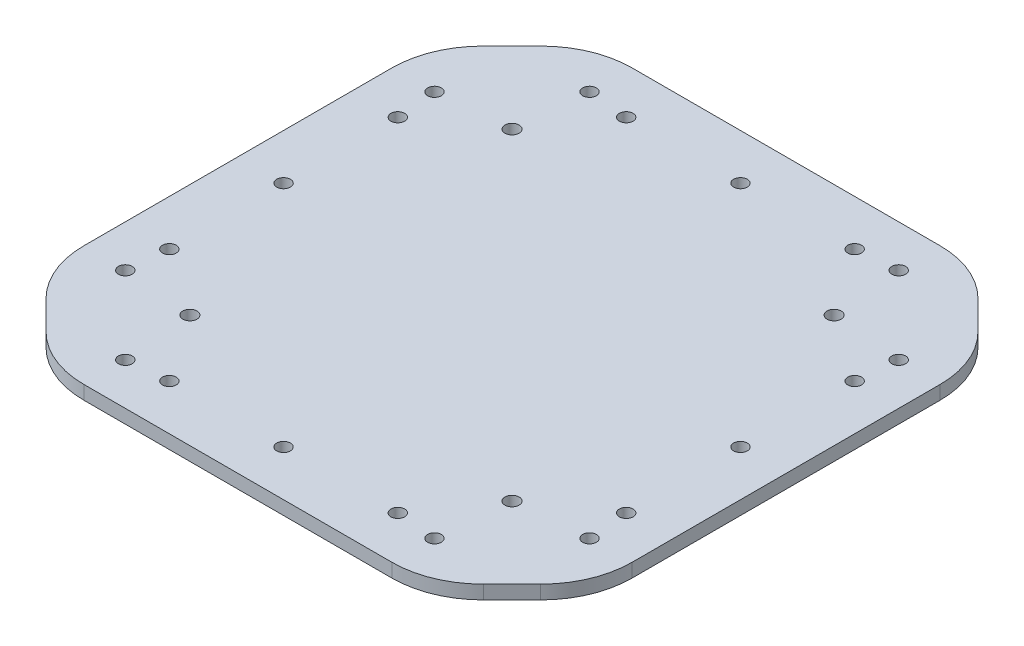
ISO-10303-21;
HEADER;
FILE_DESCRIPTION(('STEP AP214'),'2;1');
FILE_NAME('part.step','',(''),(''),'','','');
FILE_SCHEMA(('AUTOMOTIVE_DESIGN { 1 0 10303 214 1 1 1 1 }'));
ENDSEC;
DATA;
#1=APPLICATION_CONTEXT('core data for automotive mechanical design processes');
#2=APPLICATION_PROTOCOL_DEFINITION('international standard','automotive_design',2000,#1);
#3=PRODUCT_CONTEXT('',#1,'mechanical');
#4=PRODUCT('Part','Part','',(#3));
#5=PRODUCT_RELATED_PRODUCT_CATEGORY('part','',(#4));
#6=PRODUCT_DEFINITION_FORMATION('','',#4);
#7=PRODUCT_DEFINITION_CONTEXT('part definition',#1,'design');
#8=PRODUCT_DEFINITION('design','',#6,#7);
#9=PRODUCT_DEFINITION_SHAPE('','',#8);
#10=(LENGTH_UNIT() NAMED_UNIT(*) SI_UNIT(.MILLI.,.METRE.));
#11=(NAMED_UNIT(*) PLANE_ANGLE_UNIT() SI_UNIT($,.RADIAN.));
#12=(NAMED_UNIT(*) SI_UNIT($,.STERADIAN.) SOLID_ANGLE_UNIT());
#13=UNCERTAINTY_MEASURE_WITH_UNIT(LENGTH_MEASURE(1.E-05),#10,'distance_accuracy_value','');
#14=(GEOMETRIC_REPRESENTATION_CONTEXT(3) GLOBAL_UNCERTAINTY_ASSIGNED_CONTEXT((#13)) GLOBAL_UNIT_ASSIGNED_CONTEXT((#10,
#11,#12)) REPRESENTATION_CONTEXT('',''));
#15=CARTESIAN_POINT('',(0.,0.,0.));
#16=DIRECTION('',(0.,0.,1.));
#17=DIRECTION('',(1.,0.,0.));
#18=AXIS2_PLACEMENT_3D('',#15,#16,#17);
#19=CARTESIAN_POINT('',(-51.0000000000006,3.,50.9999999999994));
#20=DIRECTION('',(-0.707106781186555,0.,0.707106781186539));
#21=DIRECTION('',(0.70710678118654,0.,0.707106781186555));
#22=AXIS2_PLACEMENT_3D('',#19,#20,#21);
#23=PLANE('',#22);
#24=DIRECTION('',(-0.70710678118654,0.,-0.707106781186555));
#25=VECTOR('',#24,1.);
#26=CARTESIAN_POINT('',(-51.0000000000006,0.,50.9999999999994));
#27=LINE('',#26,#25);
#28=CARTESIAN_POINT('',(-47.8578643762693,0.,54.1421356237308));
#29=VERTEX_POINT('',#28);
#30=CARTESIAN_POINT('',(-54.1421356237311,0.,47.8578643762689));
#31=VERTEX_POINT('',#30);
#32=EDGE_CURVE('E192',#29,#31,#27,.T.);
#33=ORIENTED_EDGE('',*,*,#32,.F.);
#34=DIRECTION('',(0.,-1.,0.));
#35=VECTOR('',#34,1.);
#36=CARTESIAN_POINT('',(-47.8578643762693,3.,54.1421356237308));
#37=LINE('',#36,#35);
#38=CARTESIAN_POINT('',(-47.8578643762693,3.,54.1421356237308));
#39=VERTEX_POINT('',#38);
#40=EDGE_CURVE('E166',#29,#39,#37,.F.);
#41=ORIENTED_EDGE('',*,*,#40,.T.);
#42=DIRECTION('',(-0.70710678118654,0.,-0.707106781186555));
#43=VECTOR('',#42,1.);
#44=CARTESIAN_POINT('',(-51.0000000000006,3.,50.9999999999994));
#45=LINE('',#44,#43);
#46=CARTESIAN_POINT('',(-54.1421356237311,3.,47.8578643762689));
#47=VERTEX_POINT('',#46);
#48=EDGE_CURVE('E328',#39,#47,#45,.T.);
#49=ORIENTED_EDGE('',*,*,#48,.T.);
#50=DIRECTION('',(0.,-1.,0.));
#51=VECTOR('',#50,1.);
#52=CARTESIAN_POINT('',(-54.1421356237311,0.,47.8578643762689));
#53=LINE('',#52,#51);
#54=EDGE_CURVE('E172',#47,#31,#53,.T.);
#55=ORIENTED_EDGE('',*,*,#54,.T.);
#56=EDGE_LOOP('',(#33,#41,#49,#55));
#57=FACE_BOUND('',#56,.T.);
#58=ADVANCED_FACE('F45',(#57),#23,.T.);
#59=CARTESIAN_POINT('',(0.,3.,60.));
#60=DIRECTION('',(0.,0.,-1.));
#61=DIRECTION('',(-1.,0.,0.));
#62=AXIS2_PLACEMENT_3D('',#59,#60,#61);
#63=PLANE('',#62);
#64=DIRECTION('',(1.,0.,0.));
#65=VECTOR('',#64,1.);
#66=CARTESIAN_POINT('',(0.,3.,60.));
#67=LINE('',#66,#65);
#68=CARTESIAN_POINT('',(-33.7157287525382,3.,60.));
#69=VERTEX_POINT('',#68);
#70=CARTESIAN_POINT('',(33.7157287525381,3.,60.));
#71=VERTEX_POINT('',#70);
#72=EDGE_CURVE('E182',#69,#71,#67,.T.);
#73=ORIENTED_EDGE('',*,*,#72,.F.);
#74=DIRECTION('',(0.,-1.,0.));
#75=VECTOR('',#74,1.);
#76=CARTESIAN_POINT('',(-33.7157287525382,0.,60.));
#77=LINE('',#76,#75);
#78=CARTESIAN_POINT('',(-33.7157287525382,0.,60.));
#79=VERTEX_POINT('',#78);
#80=EDGE_CURVE('E165',#69,#79,#77,.T.);
#81=ORIENTED_EDGE('',*,*,#80,.T.);
#82=DIRECTION('',(1.,0.,0.));
#83=VECTOR('',#82,1.);
#84=CARTESIAN_POINT('',(0.,0.,60.));
#85=LINE('',#84,#83);
#86=CARTESIAN_POINT('',(33.7157287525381,0.,60.));
#87=VERTEX_POINT('',#86);
#88=EDGE_CURVE('E179',#79,#87,#85,.T.);
#89=ORIENTED_EDGE('',*,*,#88,.T.);
#90=DIRECTION('',(0.,-1.,0.));
#91=VECTOR('',#90,1.);
#92=CARTESIAN_POINT('',(33.7157287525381,3.,60.));
#93=LINE('',#92,#91);
#94=EDGE_CURVE('E185',#87,#71,#93,.F.);
#95=ORIENTED_EDGE('',*,*,#94,.T.);
#96=EDGE_LOOP('',(#73,#81,#89,#95));
#97=FACE_BOUND('',#96,.T.);
#98=ADVANCED_FACE('F178',(#97),#63,.F.);
#99=CARTESIAN_POINT('',(50.9999999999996,3.,51.0000000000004));
#100=DIRECTION('',(0.707106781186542,0.,0.707106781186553));
#101=DIRECTION('',(0.707106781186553,0.,-0.707106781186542));
#102=AXIS2_PLACEMENT_3D('',#99,#100,#101);
#103=PLANE('',#102);
#104=DIRECTION('',(-0.707106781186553,0.,0.707106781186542));
#105=VECTOR('',#104,1.);
#106=CARTESIAN_POINT('',(50.9999999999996,3.,51.0000000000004));
#107=LINE('',#106,#105);
#108=CARTESIAN_POINT('',(54.1421356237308,3.,47.8578643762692));
#109=VERTEX_POINT('',#108);
#110=CARTESIAN_POINT('',(47.8578643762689,3.,54.1421356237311));
#111=VERTEX_POINT('',#110);
#112=EDGE_CURVE('E334',#109,#111,#107,.T.);
#113=ORIENTED_EDGE('',*,*,#112,.T.);
#114=DIRECTION('',(0.,-1.,0.));
#115=VECTOR('',#114,1.);
#116=CARTESIAN_POINT('',(47.8578643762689,0.,54.1421356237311));
#117=LINE('',#116,#115);
#118=CARTESIAN_POINT('',(47.8578643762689,0.,54.1421356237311));
#119=VERTEX_POINT('',#118);
#120=EDGE_CURVE('E279',#111,#119,#117,.T.);
#121=ORIENTED_EDGE('',*,*,#120,.T.);
#122=DIRECTION('',(-0.707106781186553,0.,0.707106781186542));
#123=VECTOR('',#122,1.);
#124=CARTESIAN_POINT('',(50.9999999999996,0.,51.0000000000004));
#125=LINE('',#124,#123);
#126=CARTESIAN_POINT('',(54.1421356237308,0.,47.8578643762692));
#127=VERTEX_POINT('',#126);
#128=EDGE_CURVE('E191',#127,#119,#125,.T.);
#129=ORIENTED_EDGE('',*,*,#128,.F.);
#130=DIRECTION('',(0.,-1.,0.));
#131=VECTOR('',#130,1.);
#132=CARTESIAN_POINT('',(54.1421356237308,3.,47.8578643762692));
#133=LINE('',#132,#131);
#134=EDGE_CURVE('E276',#127,#109,#133,.F.);
#135=ORIENTED_EDGE('',*,*,#134,.T.);
#136=EDGE_LOOP('',(#113,#121,#129,#135));
#137=FACE_BOUND('',#136,.T.);
#138=ADVANCED_FACE('F472',(#137),#103,.T.);
#139=CARTESIAN_POINT('',(60.,3.,0.));
#140=DIRECTION('',(1.,0.,0.));
#141=DIRECTION('',(0.,0.,-1.));
#142=AXIS2_PLACEMENT_3D('',#139,#140,#141);
#143=PLANE('',#142);
#144=DIRECTION('',(0.,0.,1.));
#145=VECTOR('',#144,1.);
#146=CARTESIAN_POINT('',(60.,3.,0.));
#147=LINE('',#146,#145);
#148=CARTESIAN_POINT('',(60.,3.,-33.7157287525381));
#149=VERTEX_POINT('',#148);
#150=CARTESIAN_POINT('',(60.,3.,33.7157287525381));
#151=VERTEX_POINT('',#150);
#152=EDGE_CURVE('E344',#149,#151,#147,.T.);
#153=ORIENTED_EDGE('',*,*,#152,.T.);
#154=DIRECTION('',(0.,-1.,0.));
#155=VECTOR('',#154,1.);
#156=CARTESIAN_POINT('',(60.,3.,33.7157287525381));
#157=LINE('',#156,#155);
#158=CARTESIAN_POINT('',(60.,0.,33.7157287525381));
#159=VERTEX_POINT('',#158);
#160=EDGE_CURVE('E286',#151,#159,#157,.T.);
#161=ORIENTED_EDGE('',*,*,#160,.T.);
#162=DIRECTION('',(0.,0.,1.));
#163=VECTOR('',#162,1.);
#164=CARTESIAN_POINT('',(60.,0.,0.));
#165=LINE('',#164,#163);
#166=CARTESIAN_POINT('',(60.,0.,-33.7157287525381));
#167=VERTEX_POINT('',#166);
#168=EDGE_CURVE('E196',#167,#159,#165,.T.);
#169=ORIENTED_EDGE('',*,*,#168,.F.);
#170=DIRECTION('',(0.,-1.,0.));
#171=VECTOR('',#170,1.);
#172=CARTESIAN_POINT('',(60.,3.,-33.7157287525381));
#173=LINE('',#172,#171);
#174=EDGE_CURVE('E283',#167,#149,#173,.F.);
#175=ORIENTED_EDGE('',*,*,#174,.T.);
#176=EDGE_LOOP('',(#153,#161,#169,#175));
#177=FACE_BOUND('',#176,.T.);
#178=ADVANCED_FACE('F477',(#177),#143,.T.);
#179=CARTESIAN_POINT('',(51.0000000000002,3.,-50.9999999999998));
#180=DIRECTION('',(0.70710678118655,0.,-0.707106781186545));
#181=DIRECTION('',(-0.707106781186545,0.,-0.70710678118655));
#182=AXIS2_PLACEMENT_3D('',#179,#180,#181);
#183=PLANE('',#182);
#184=DIRECTION('',(0.707106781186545,0.,0.70710678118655));
#185=VECTOR('',#184,1.);
#186=CARTESIAN_POINT('',(51.0000000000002,0.,-50.9999999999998));
#187=LINE('',#186,#185);
#188=CARTESIAN_POINT('',(47.8578643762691,0.,-54.1421356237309));
#189=VERTEX_POINT('',#188);
#190=CARTESIAN_POINT('',(54.142135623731,0.,-47.857864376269));
#191=VERTEX_POINT('',#190);
#192=EDGE_CURVE('E205',#189,#191,#187,.T.);
#193=ORIENTED_EDGE('',*,*,#192,.F.);
#194=DIRECTION('',(0.,-1.,0.));
#195=VECTOR('',#194,1.);
#196=CARTESIAN_POINT('',(47.8578643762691,3.,-54.1421356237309));
#197=LINE('',#196,#195);
#198=CARTESIAN_POINT('',(47.8578643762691,3.,-54.1421356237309));
#199=VERTEX_POINT('',#198);
#200=EDGE_CURVE('E301',#189,#199,#197,.F.);
#201=ORIENTED_EDGE('',*,*,#200,.T.);
#202=DIRECTION('',(0.707106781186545,0.,0.70710678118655));
#203=VECTOR('',#202,1.);
#204=CARTESIAN_POINT('',(51.0000000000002,3.,-50.9999999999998));
#205=LINE('',#204,#203);
#206=CARTESIAN_POINT('',(54.142135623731,3.,-47.857864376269));
#207=VERTEX_POINT('',#206);
#208=EDGE_CURVE('E348',#199,#207,#205,.T.);
#209=ORIENTED_EDGE('',*,*,#208,.T.);
#210=DIRECTION('',(0.,-1.,0.));
#211=VECTOR('',#210,1.);
#212=CARTESIAN_POINT('',(54.142135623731,3.,-47.857864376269));
#213=LINE('',#212,#211);
#214=EDGE_CURVE('E297',#207,#191,#213,.T.);
#215=ORIENTED_EDGE('',*,*,#214,.T.);
#216=EDGE_LOOP('',(#193,#201,#209,#215));
#217=FACE_BOUND('',#216,.T.);
#218=ADVANCED_FACE('F481',(#217),#183,.T.);
#219=CARTESIAN_POINT('',(0.,3.,-60.));
#220=DIRECTION('',(0.,0.,-1.));
#221=DIRECTION('',(-1.,0.,0.));
#222=AXIS2_PLACEMENT_3D('',#219,#220,#221);
#223=PLANE('',#222);
#224=DIRECTION('',(1.,0.,0.));
#225=VECTOR('',#224,1.);
#226=CARTESIAN_POINT('',(0.,3.,-60.));
#227=LINE('',#226,#225);
#228=CARTESIAN_POINT('',(-33.7157287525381,3.,-60.));
#229=VERTEX_POINT('',#228);
#230=CARTESIAN_POINT('',(33.7157287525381,3.,-60.));
#231=VERTEX_POINT('',#230);
#232=EDGE_CURVE('E317',#229,#231,#227,.T.);
#233=ORIENTED_EDGE('',*,*,#232,.T.);
#234=DIRECTION('',(0.,-1.,0.));
#235=VECTOR('',#234,1.);
#236=CARTESIAN_POINT('',(33.7157287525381,3.,-60.));
#237=LINE('',#236,#235);
#238=CARTESIAN_POINT('',(33.7157287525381,0.,-60.));
#239=VERTEX_POINT('',#238);
#240=EDGE_CURVE('E293',#231,#239,#237,.T.);
#241=ORIENTED_EDGE('',*,*,#240,.T.);
#242=DIRECTION('',(1.,0.,0.));
#243=VECTOR('',#242,1.);
#244=CARTESIAN_POINT('',(0.,0.,-60.));
#245=LINE('',#244,#243);
#246=CARTESIAN_POINT('',(-33.7157287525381,0.,-60.));
#247=VERTEX_POINT('',#246);
#248=EDGE_CURVE('E209',#247,#239,#245,.T.);
#249=ORIENTED_EDGE('',*,*,#248,.F.);
#250=DIRECTION('',(0.,-1.,0.));
#251=VECTOR('',#250,1.);
#252=CARTESIAN_POINT('',(-33.7157287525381,3.,-60.));
#253=LINE('',#252,#251);
#254=EDGE_CURVE('E290',#247,#229,#253,.F.);
#255=ORIENTED_EDGE('',*,*,#254,.T.);
#256=EDGE_LOOP('',(#233,#241,#249,#255));
#257=FACE_BOUND('',#256,.T.);
#258=ADVANCED_FACE('F465',(#257),#223,.T.);
#259=CARTESIAN_POINT('',(-51.,3.,-51.));
#260=DIRECTION('',(-0.707106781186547,0.,-0.707106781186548));
#261=DIRECTION('',(-0.707106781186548,0.,0.707106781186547));
#262=AXIS2_PLACEMENT_3D('',#259,#260,#261);
#263=PLANE('',#262);
#264=DIRECTION('',(0.707106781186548,0.,-0.707106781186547));
#265=VECTOR('',#264,1.);
#266=CARTESIAN_POINT('',(-51.,3.,-51.));
#267=LINE('',#266,#265);
#268=CARTESIAN_POINT('',(-54.1421356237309,3.,-47.8578643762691));
#269=VERTEX_POINT('',#268);
#270=CARTESIAN_POINT('',(-47.857864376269,3.,-54.142135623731));
#271=VERTEX_POINT('',#270);
#272=EDGE_CURVE('E309',#269,#271,#267,.T.);
#273=ORIENTED_EDGE('',*,*,#272,.T.);
#274=DIRECTION('',(0.,-1.,0.));
#275=VECTOR('',#274,1.);
#276=CARTESIAN_POINT('',(-47.857864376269,3.,-54.142135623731));
#277=LINE('',#276,#275);
#278=CARTESIAN_POINT('',(-47.857864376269,0.,-54.142135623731));
#279=VERTEX_POINT('',#278);
#280=EDGE_CURVE('E11',#271,#279,#277,.T.);
#281=ORIENTED_EDGE('',*,*,#280,.T.);
#282=DIRECTION('',(0.707106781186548,0.,-0.707106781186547));
#283=VECTOR('',#282,1.);
#284=CARTESIAN_POINT('',(-51.,0.,-51.));
#285=LINE('',#284,#283);
#286=CARTESIAN_POINT('',(-54.1421356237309,0.,-47.8578643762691));
#287=VERTEX_POINT('',#286);
#288=EDGE_CURVE('E213',#287,#279,#285,.T.);
#289=ORIENTED_EDGE('',*,*,#288,.F.);
#290=DIRECTION('',(0.,-1.,0.));
#291=VECTOR('',#290,1.);
#292=CARTESIAN_POINT('',(-54.1421356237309,3.,-47.8578643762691));
#293=LINE('',#292,#291);
#294=EDGE_CURVE('E54',#287,#269,#293,.F.);
#295=ORIENTED_EDGE('',*,*,#294,.T.);
#296=EDGE_LOOP('',(#273,#281,#289,#295));
#297=FACE_BOUND('',#296,.T.);
#298=ADVANCED_FACE('F308',(#297),#263,.T.);
#299=CARTESIAN_POINT('',(-35.2512626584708,3.,-35.2512626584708));
#300=DIRECTION('',(0.,-1.,0.));
#301=DIRECTION('',(0.,0.,-1.));
#302=AXIS2_PLACEMENT_3D('',#299,#300,#301);
#303=CYLINDRICAL_SURFACE('',#302,1.55579192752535);
#304=CARTESIAN_POINT('',(-35.2512626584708,3.,-35.2512626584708));
#305=DIRECTION('',(0.,1.,0.));
#306=DIRECTION('',(0.,0.,1.));
#307=AXIS2_PLACEMENT_3D('',#304,#305,#306);
#308=CIRCLE('',#307,1.55579192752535);
#309=CARTESIAN_POINT('',(-35.2512626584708,3.,-33.6954707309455));
#310=VERTEX_POINT('',#309);
#311=EDGE_CURVE('E330',#310,#310,#308,.T.);
#312=ORIENTED_EDGE('',*,*,#311,.T.);
#313=EDGE_LOOP('',(#312));
#314=FACE_BOUND('',#313,.T.);
#315=CARTESIAN_POINT('',(-35.2512626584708,0.,-35.2512626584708));
#316=DIRECTION('',(0.,1.,0.));
#317=DIRECTION('',(0.,0.,1.));
#318=AXIS2_PLACEMENT_3D('',#315,#316,#317);
#319=CIRCLE('',#318,1.55579192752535);
#320=CARTESIAN_POINT('',(-35.2512626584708,0.,-33.6954707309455));
#321=VERTEX_POINT('',#320);
#322=EDGE_CURVE('E198',#321,#321,#319,.T.);
#323=ORIENTED_EDGE('',*,*,#322,.F.);
#324=EDGE_LOOP('',(#323));
#325=FACE_BOUND('',#324,.T.);
#326=ADVANCED_FACE('F453',(#314,#325),#303,.F.);
#327=CARTESIAN_POINT('',(-33.8370490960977,3.,-50.8076118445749));
#328=DIRECTION('',(0.,-1.,0.));
#329=DIRECTION('',(0.,0.,-1.));
#330=AXIS2_PLACEMENT_3D('',#327,#328,#329);
#331=CYLINDRICAL_SURFACE('',#330,1.50000000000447);
#332=CARTESIAN_POINT('',(-33.8370490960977,3.,-50.8076118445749));
#333=DIRECTION('',(0.,1.,0.));
#334=DIRECTION('',(0.,0.,1.));
#335=AXIS2_PLACEMENT_3D('',#332,#333,#334);
#336=CIRCLE('',#335,1.50000000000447);
#337=CARTESIAN_POINT('',(-33.8370490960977,3.,-49.3076118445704));
#338=VERTEX_POINT('',#337);
#339=EDGE_CURVE('E337',#338,#338,#336,.T.);
#340=ORIENTED_EDGE('',*,*,#339,.T.);
#341=EDGE_LOOP('',(#340));
#342=FACE_BOUND('',#341,.T.);
#343=CARTESIAN_POINT('',(-33.8370490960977,0.,-50.8076118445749));
#344=DIRECTION('',(0.,1.,0.));
#345=DIRECTION('',(0.,0.,1.));
#346=AXIS2_PLACEMENT_3D('',#343,#344,#345);
#347=CIRCLE('',#346,1.50000000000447);
#348=CARTESIAN_POINT('',(-33.8370490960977,0.,-49.3076118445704));
#349=VERTEX_POINT('',#348);
#350=EDGE_CURVE('E445',#349,#349,#347,.T.);
#351=ORIENTED_EDGE('',*,*,#350,.F.);
#352=EDGE_LOOP('',(#351));
#353=FACE_BOUND('',#352,.T.);
#354=ADVANCED_FACE('F455',(#342,#353),#331,.F.);
#355=CARTESIAN_POINT('',(-50.8076118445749,3.,-33.8370490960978));
#356=DIRECTION('',(0.,-1.,0.));
#357=DIRECTION('',(0.,0.,-1.));
#358=AXIS2_PLACEMENT_3D('',#355,#356,#357);
#359=CYLINDRICAL_SURFACE('',#358,1.50000000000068);
#360=CARTESIAN_POINT('',(-50.8076118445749,3.,-33.8370490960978));
#361=DIRECTION('',(0.,1.,0.));
#362=DIRECTION('',(0.,0.,1.));
#363=AXIS2_PLACEMENT_3D('',#360,#361,#362);
#364=CIRCLE('',#363,1.50000000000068);
#365=CARTESIAN_POINT('',(-50.8076118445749,3.,-32.3370490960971));
#366=VERTEX_POINT('',#365);
#367=EDGE_CURVE('E585',#366,#366,#364,.T.);
#368=ORIENTED_EDGE('',*,*,#367,.T.);
#369=EDGE_LOOP('',(#368));
#370=FACE_BOUND('',#369,.T.);
#371=CARTESIAN_POINT('',(-50.8076118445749,0.,-33.8370490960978));
#372=DIRECTION('',(0.,1.,0.));
#373=DIRECTION('',(0.,0.,1.));
#374=AXIS2_PLACEMENT_3D('',#371,#372,#373);
#375=CIRCLE('',#374,1.50000000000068);
#376=CARTESIAN_POINT('',(-50.8076118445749,0.,-32.3370490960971));
#377=VERTEX_POINT('',#376);
#378=EDGE_CURVE('E441',#377,#377,#375,.T.);
#379=ORIENTED_EDGE('',*,*,#378,.F.);
#380=EDGE_LOOP('',(#379));
#381=FACE_BOUND('',#380,.T.);
#382=ADVANCED_FACE('F462',(#370,#381),#359,.F.);
#383=CARTESIAN_POINT('',(33.8370490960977,3.,-50.8076118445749));
#384=DIRECTION('',(0.,-1.,0.));
#385=DIRECTION('',(0.,0.,-1.));
#386=AXIS2_PLACEMENT_3D('',#383,#384,#385);
#387=CYLINDRICAL_SURFACE('',#386,1.50000000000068);
#388=CARTESIAN_POINT('',(33.8370490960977,3.,-50.8076118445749));
#389=DIRECTION('',(0.,1.,0.));
#390=DIRECTION('',(0.,0.,1.));
#391=AXIS2_PLACEMENT_3D('',#388,#389,#390);
#392=CIRCLE('',#391,1.50000000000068);
#393=CARTESIAN_POINT('',(33.8370490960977,3.,-49.3076118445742));
#394=VERTEX_POINT('',#393);
#395=EDGE_CURVE('E581',#394,#394,#392,.T.);
#396=ORIENTED_EDGE('',*,*,#395,.T.);
#397=EDGE_LOOP('',(#396));
#398=FACE_BOUND('',#397,.T.);
#399=CARTESIAN_POINT('',(33.8370490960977,0.,-50.8076118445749));
#400=DIRECTION('',(0.,1.,0.));
#401=DIRECTION('',(0.,0.,1.));
#402=AXIS2_PLACEMENT_3D('',#399,#400,#401);
#403=CIRCLE('',#402,1.50000000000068);
#404=CARTESIAN_POINT('',(33.8370490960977,0.,-49.3076118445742));
#405=VERTEX_POINT('',#404);
#406=EDGE_CURVE('E437',#405,#405,#403,.T.);
#407=ORIENTED_EDGE('',*,*,#406,.F.);
#408=EDGE_LOOP('',(#407));
#409=FACE_BOUND('',#408,.T.);
#410=ADVANCED_FACE('F688',(#398,#409),#387,.F.);
#411=CARTESIAN_POINT('',(35.2512626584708,3.,-35.2512626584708));
#412=DIRECTION('',(0.,-1.,0.));
#413=DIRECTION('',(0.,0.,-1.));
#414=AXIS2_PLACEMENT_3D('',#411,#412,#413);
#415=CYLINDRICAL_SURFACE('',#414,1.55579192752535);
#416=CARTESIAN_POINT('',(35.2512626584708,3.,-35.2512626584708));
#417=DIRECTION('',(0.,1.,0.));
#418=DIRECTION('',(0.,0.,1.));
#419=AXIS2_PLACEMENT_3D('',#416,#417,#418);
#420=CIRCLE('',#419,1.55579192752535);
#421=CARTESIAN_POINT('',(35.2512626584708,3.,-33.6954707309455));
#422=VERTEX_POINT('',#421);
#423=EDGE_CURVE('E577',#422,#422,#420,.T.);
#424=ORIENTED_EDGE('',*,*,#423,.T.);
#425=EDGE_LOOP('',(#424));
#426=FACE_BOUND('',#425,.T.);
#427=CARTESIAN_POINT('',(35.2512626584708,0.,-35.2512626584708));
#428=DIRECTION('',(0.,1.,0.));
#429=DIRECTION('',(0.,0.,1.));
#430=AXIS2_PLACEMENT_3D('',#427,#428,#429);
#431=CIRCLE('',#430,1.55579192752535);
#432=CARTESIAN_POINT('',(35.2512626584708,0.,-33.6954707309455));
#433=VERTEX_POINT('',#432);
#434=EDGE_CURVE('E433',#433,#433,#431,.T.);
#435=ORIENTED_EDGE('',*,*,#434,.F.);
#436=EDGE_LOOP('',(#435));
#437=FACE_BOUND('',#436,.T.);
#438=ADVANCED_FACE('F694',(#426,#437),#415,.F.);
#439=CARTESIAN_POINT('',(50.8076118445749,3.,-33.8370490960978));
#440=DIRECTION('',(0.,-1.,0.));
#441=DIRECTION('',(0.,0.,-1.));
#442=AXIS2_PLACEMENT_3D('',#439,#440,#441);
#443=CYLINDRICAL_SURFACE('',#442,1.50000000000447);
#444=CARTESIAN_POINT('',(50.8076118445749,3.,-33.8370490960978));
#445=DIRECTION('',(0.,1.,0.));
#446=DIRECTION('',(0.,0.,1.));
#447=AXIS2_PLACEMENT_3D('',#444,#445,#446);
#448=CIRCLE('',#447,1.50000000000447);
#449=CARTESIAN_POINT('',(50.8076118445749,3.,-32.3370490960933));
#450=VERTEX_POINT('',#449);
#451=EDGE_CURVE('E573',#450,#450,#448,.T.);
#452=ORIENTED_EDGE('',*,*,#451,.T.);
#453=EDGE_LOOP('',(#452));
#454=FACE_BOUND('',#453,.T.);
#455=CARTESIAN_POINT('',(50.8076118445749,0.,-33.8370490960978));
#456=DIRECTION('',(0.,1.,0.));
#457=DIRECTION('',(0.,0.,1.));
#458=AXIS2_PLACEMENT_3D('',#455,#456,#457);
#459=CIRCLE('',#458,1.50000000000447);
#460=CARTESIAN_POINT('',(50.8076118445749,0.,-32.3370490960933));
#461=VERTEX_POINT('',#460);
#462=EDGE_CURVE('E429',#461,#461,#459,.T.);
#463=ORIENTED_EDGE('',*,*,#462,.F.);
#464=EDGE_LOOP('',(#463));
#465=FACE_BOUND('',#464,.T.);
#466=ADVANCED_FACE('F700',(#454,#465),#443,.F.);
#467=CARTESIAN_POINT('',(50.8076118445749,3.,33.8370490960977));
#468=DIRECTION('',(0.,-1.,0.));
#469=DIRECTION('',(0.,0.,-1.));
#470=AXIS2_PLACEMENT_3D('',#467,#468,#469);
#471=CYLINDRICAL_SURFACE('',#470,1.50000000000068);
#472=CARTESIAN_POINT('',(50.8076118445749,3.,33.8370490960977));
#473=DIRECTION('',(0.,1.,0.));
#474=DIRECTION('',(0.,0.,1.));
#475=AXIS2_PLACEMENT_3D('',#472,#473,#474);
#476=CIRCLE('',#475,1.50000000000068);
#477=CARTESIAN_POINT('',(50.8076118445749,3.,35.3370490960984));
#478=VERTEX_POINT('',#477);
#479=EDGE_CURVE('E569',#478,#478,#476,.T.);
#480=ORIENTED_EDGE('',*,*,#479,.T.);
#481=EDGE_LOOP('',(#480));
#482=FACE_BOUND('',#481,.T.);
#483=CARTESIAN_POINT('',(50.8076118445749,0.,33.8370490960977));
#484=DIRECTION('',(0.,1.,0.));
#485=DIRECTION('',(0.,0.,1.));
#486=AXIS2_PLACEMENT_3D('',#483,#484,#485);
#487=CIRCLE('',#486,1.50000000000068);
#488=CARTESIAN_POINT('',(50.8076118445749,0.,35.3370490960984));
#489=VERTEX_POINT('',#488);
#490=EDGE_CURVE('E425',#489,#489,#487,.T.);
#491=ORIENTED_EDGE('',*,*,#490,.F.);
#492=EDGE_LOOP('',(#491));
#493=FACE_BOUND('',#492,.T.);
#494=ADVANCED_FACE('F704',(#482,#493),#471,.F.);
#495=CARTESIAN_POINT('',(35.2512626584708,3.,35.2512626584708));
#496=DIRECTION('',(0.,-1.,0.));
#497=DIRECTION('',(0.,0.,-1.));
#498=AXIS2_PLACEMENT_3D('',#495,#496,#497);
#499=CYLINDRICAL_SURFACE('',#498,1.55579192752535);
#500=CARTESIAN_POINT('',(35.2512626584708,3.,35.2512626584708));
#501=DIRECTION('',(0.,1.,0.));
#502=DIRECTION('',(0.,0.,1.));
#503=AXIS2_PLACEMENT_3D('',#500,#501,#502);
#504=CIRCLE('',#503,1.55579192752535);
#505=CARTESIAN_POINT('',(35.2512626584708,3.,36.8070545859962));
#506=VERTEX_POINT('',#505);
#507=EDGE_CURVE('E565',#506,#506,#504,.T.);
#508=ORIENTED_EDGE('',*,*,#507,.T.);
#509=EDGE_LOOP('',(#508));
#510=FACE_BOUND('',#509,.T.);
#511=CARTESIAN_POINT('',(35.2512626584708,0.,35.2512626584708));
#512=DIRECTION('',(0.,1.,0.));
#513=DIRECTION('',(0.,0.,1.));
#514=AXIS2_PLACEMENT_3D('',#511,#512,#513);
#515=CIRCLE('',#514,1.55579192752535);
#516=CARTESIAN_POINT('',(35.2512626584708,0.,36.8070545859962));
#517=VERTEX_POINT('',#516);
#518=EDGE_CURVE('E421',#517,#517,#515,.T.);
#519=ORIENTED_EDGE('',*,*,#518,.F.);
#520=EDGE_LOOP('',(#519));
#521=FACE_BOUND('',#520,.T.);
#522=ADVANCED_FACE('F708',(#510,#521),#499,.F.);
#523=CARTESIAN_POINT('',(33.8370490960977,3.,50.8076118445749));
#524=DIRECTION('',(0.,-1.,0.));
#525=DIRECTION('',(0.,0.,-1.));
#526=AXIS2_PLACEMENT_3D('',#523,#524,#525);
#527=CYLINDRICAL_SURFACE('',#526,1.50000000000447);
#528=CARTESIAN_POINT('',(33.8370490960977,3.,50.8076118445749));
#529=DIRECTION('',(0.,1.,0.));
#530=DIRECTION('',(0.,0.,1.));
#531=AXIS2_PLACEMENT_3D('',#528,#529,#530);
#532=CIRCLE('',#531,1.50000000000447);
#533=CARTESIAN_POINT('',(33.8370490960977,3.,52.3076118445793));
#534=VERTEX_POINT('',#533);
#535=EDGE_CURVE('E561',#534,#534,#532,.T.);
#536=ORIENTED_EDGE('',*,*,#535,.T.);
#537=EDGE_LOOP('',(#536));
#538=FACE_BOUND('',#537,.T.);
#539=CARTESIAN_POINT('',(33.8370490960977,0.,50.8076118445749));
#540=DIRECTION('',(0.,1.,0.));
#541=DIRECTION('',(0.,0.,1.));
#542=AXIS2_PLACEMENT_3D('',#539,#540,#541);
#543=CIRCLE('',#542,1.50000000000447);
#544=CARTESIAN_POINT('',(33.8370490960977,0.,52.3076118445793));
#545=VERTEX_POINT('',#544);
#546=EDGE_CURVE('E417',#545,#545,#543,.T.);
#547=ORIENTED_EDGE('',*,*,#546,.F.);
#548=EDGE_LOOP('',(#547));
#549=FACE_BOUND('',#548,.T.);
#550=ADVANCED_FACE('F712',(#538,#549),#527,.F.);
#551=CARTESIAN_POINT('',(-33.8370490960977,3.,50.8076118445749));
#552=DIRECTION('',(0.,-1.,0.));
#553=DIRECTION('',(0.,0.,-1.));
#554=AXIS2_PLACEMENT_3D('',#551,#552,#553);
#555=CYLINDRICAL_SURFACE('',#554,1.50000000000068);
#556=CARTESIAN_POINT('',(-33.8370490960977,3.,50.8076118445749));
#557=DIRECTION('',(0.,1.,0.));
#558=DIRECTION('',(0.,0.,1.));
#559=AXIS2_PLACEMENT_3D('',#556,#557,#558);
#560=CIRCLE('',#559,1.50000000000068);
#561=CARTESIAN_POINT('',(-33.8370490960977,3.,52.3076118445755));
#562=VERTEX_POINT('',#561);
#563=EDGE_CURVE('E557',#562,#562,#560,.T.);
#564=ORIENTED_EDGE('',*,*,#563,.T.);
#565=EDGE_LOOP('',(#564));
#566=FACE_BOUND('',#565,.T.);
#567=CARTESIAN_POINT('',(-33.8370490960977,0.,50.8076118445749));
#568=DIRECTION('',(0.,1.,0.));
#569=DIRECTION('',(0.,0.,1.));
#570=AXIS2_PLACEMENT_3D('',#567,#568,#569);
#571=CIRCLE('',#570,1.50000000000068);
#572=CARTESIAN_POINT('',(-33.8370490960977,0.,52.3076118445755));
#573=VERTEX_POINT('',#572);
#574=EDGE_CURVE('E413',#573,#573,#571,.T.);
#575=ORIENTED_EDGE('',*,*,#574,.F.);
#576=EDGE_LOOP('',(#575));
#577=FACE_BOUND('',#576,.T.);
#578=ADVANCED_FACE('F716',(#566,#577),#555,.F.);
#579=CARTESIAN_POINT('',(-35.2512626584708,3.,35.2512626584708));
#580=DIRECTION('',(0.,-1.,0.));
#581=DIRECTION('',(0.,0.,-1.));
#582=AXIS2_PLACEMENT_3D('',#579,#580,#581);
#583=CYLINDRICAL_SURFACE('',#582,1.55579192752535);
#584=CARTESIAN_POINT('',(-35.2512626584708,3.,35.2512626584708));
#585=DIRECTION('',(0.,1.,0.));
#586=DIRECTION('',(0.,0.,1.));
#587=AXIS2_PLACEMENT_3D('',#584,#585,#586);
#588=CIRCLE('',#587,1.55579192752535);
#589=CARTESIAN_POINT('',(-35.2512626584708,3.,36.8070545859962));
#590=VERTEX_POINT('',#589);
#591=EDGE_CURVE('E553',#590,#590,#588,.T.);
#592=ORIENTED_EDGE('',*,*,#591,.T.);
#593=EDGE_LOOP('',(#592));
#594=FACE_BOUND('',#593,.T.);
#595=CARTESIAN_POINT('',(-35.2512626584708,0.,35.2512626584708));
#596=DIRECTION('',(0.,1.,0.));
#597=DIRECTION('',(0.,0.,1.));
#598=AXIS2_PLACEMENT_3D('',#595,#596,#597);
#599=CIRCLE('',#598,1.55579192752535);
#600=CARTESIAN_POINT('',(-35.2512626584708,0.,36.8070545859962));
#601=VERTEX_POINT('',#600);
#602=EDGE_CURVE('E409',#601,#601,#599,.T.);
#603=ORIENTED_EDGE('',*,*,#602,.F.);
#604=EDGE_LOOP('',(#603));
#605=FACE_BOUND('',#604,.T.);
#606=ADVANCED_FACE('F720',(#594,#605),#583,.F.);
#607=CARTESIAN_POINT('',(-50.8076118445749,3.,33.8370490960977));
#608=DIRECTION('',(0.,-1.,0.));
#609=DIRECTION('',(0.,0.,-1.));
#610=AXIS2_PLACEMENT_3D('',#607,#608,#609);
#611=CYLINDRICAL_SURFACE('',#610,1.50000000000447);
#612=CARTESIAN_POINT('',(-50.8076118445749,3.,33.8370490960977));
#613=DIRECTION('',(0.,1.,0.));
#614=DIRECTION('',(0.,0.,1.));
#615=AXIS2_PLACEMENT_3D('',#612,#613,#614);
#616=CIRCLE('',#615,1.50000000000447);
#617=CARTESIAN_POINT('',(-50.8076118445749,3.,35.3370490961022));
#618=VERTEX_POINT('',#617);
#619=EDGE_CURVE('E549',#618,#618,#616,.T.);
#620=ORIENTED_EDGE('',*,*,#619,.T.);
#621=EDGE_LOOP('',(#620));
#622=FACE_BOUND('',#621,.T.);
#623=CARTESIAN_POINT('',(-50.8076118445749,0.,33.8370490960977));
#624=DIRECTION('',(0.,1.,0.));
#625=DIRECTION('',(0.,0.,1.));
#626=AXIS2_PLACEMENT_3D('',#623,#624,#625);
#627=CIRCLE('',#626,1.50000000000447);
#628=CARTESIAN_POINT('',(-50.8076118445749,0.,35.3370490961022));
#629=VERTEX_POINT('',#628);
#630=EDGE_CURVE('E405',#629,#629,#627,.T.);
#631=ORIENTED_EDGE('',*,*,#630,.F.);
#632=EDGE_LOOP('',(#631));
#633=FACE_BOUND('',#632,.T.);
#634=ADVANCED_FACE('F724',(#622,#633),#611,.F.);
#635=CARTESIAN_POINT('',(-50.,3.,0.));
#636=DIRECTION('',(0.,-1.,0.));
#637=DIRECTION('',(0.,0.,-1.));
#638=AXIS2_PLACEMENT_3D('',#635,#636,#637);
#639=CYLINDRICAL_SURFACE('',#638,1.5);
#640=CARTESIAN_POINT('',(-50.,3.,0.));
#641=DIRECTION('',(0.,1.,0.));
#642=DIRECTION('',(0.,0.,1.));
#643=AXIS2_PLACEMENT_3D('',#640,#641,#642);
#644=CIRCLE('',#643,1.5);
#645=CARTESIAN_POINT('',(-50.,3.,1.5));
#646=VERTEX_POINT('',#645);
#647=EDGE_CURVE('E545',#646,#646,#644,.T.);
#648=ORIENTED_EDGE('',*,*,#647,.T.);
#649=EDGE_LOOP('',(#648));
#650=FACE_BOUND('',#649,.T.);
#651=CARTESIAN_POINT('',(-50.,0.,0.));
#652=DIRECTION('',(0.,1.,0.));
#653=DIRECTION('',(0.,0.,1.));
#654=AXIS2_PLACEMENT_3D('',#651,#652,#653);
#655=CIRCLE('',#654,1.5);
#656=CARTESIAN_POINT('',(-50.,0.,1.5));
#657=VERTEX_POINT('',#656);
#658=EDGE_CURVE('E401',#657,#657,#655,.T.);
#659=ORIENTED_EDGE('',*,*,#658,.F.);
#660=EDGE_LOOP('',(#659));
#661=FACE_BOUND('',#660,.T.);
#662=ADVANCED_FACE('F728',(#650,#661),#639,.F.);
#663=CARTESIAN_POINT('',(-50.,3.,25.));
#664=DIRECTION('',(0.,-1.,0.));
#665=DIRECTION('',(0.,0.,-1.));
#666=AXIS2_PLACEMENT_3D('',#663,#664,#665);
#667=CYLINDRICAL_SURFACE('',#666,1.5);
#668=CARTESIAN_POINT('',(-50.,3.,25.));
#669=DIRECTION('',(0.,1.,0.));
#670=DIRECTION('',(0.,0.,1.));
#671=AXIS2_PLACEMENT_3D('',#668,#669,#670);
#672=CIRCLE('',#671,1.5);
#673=CARTESIAN_POINT('',(-50.,3.,26.5));
#674=VERTEX_POINT('',#673);
#675=EDGE_CURVE('E541',#674,#674,#672,.T.);
#676=ORIENTED_EDGE('',*,*,#675,.T.);
#677=EDGE_LOOP('',(#676));
#678=FACE_BOUND('',#677,.T.);
#679=CARTESIAN_POINT('',(-50.,0.,25.));
#680=DIRECTION('',(0.,1.,0.));
#681=DIRECTION('',(0.,0.,1.));
#682=AXIS2_PLACEMENT_3D('',#679,#680,#681);
#683=CIRCLE('',#682,1.5);
#684=CARTESIAN_POINT('',(-50.,0.,26.5));
#685=VERTEX_POINT('',#684);
#686=EDGE_CURVE('E397',#685,#685,#683,.T.);
#687=ORIENTED_EDGE('',*,*,#686,.F.);
#688=EDGE_LOOP('',(#687));
#689=FACE_BOUND('',#688,.T.);
#690=ADVANCED_FACE('F732',(#678,#689),#667,.F.);
#691=CARTESIAN_POINT('',(-50.,3.,-25.));
#692=DIRECTION('',(0.,-1.,0.));
#693=DIRECTION('',(0.,0.,-1.));
#694=AXIS2_PLACEMENT_3D('',#691,#692,#693);
#695=CYLINDRICAL_SURFACE('',#694,1.50000000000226);
#696=CARTESIAN_POINT('',(-50.,3.,-25.));
#697=DIRECTION('',(0.,1.,0.));
#698=DIRECTION('',(0.,0.,1.));
#699=AXIS2_PLACEMENT_3D('',#696,#697,#698);
#700=CIRCLE('',#699,1.50000000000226);
#701=CARTESIAN_POINT('',(-50.,3.,-23.4999999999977));
#702=VERTEX_POINT('',#701);
#703=EDGE_CURVE('E537',#702,#702,#700,.T.);
#704=ORIENTED_EDGE('',*,*,#703,.T.);
#705=EDGE_LOOP('',(#704));
#706=FACE_BOUND('',#705,.T.);
#707=CARTESIAN_POINT('',(-50.,0.,-25.));
#708=DIRECTION('',(0.,1.,0.));
#709=DIRECTION('',(0.,0.,1.));
#710=AXIS2_PLACEMENT_3D('',#707,#708,#709);
#711=CIRCLE('',#710,1.50000000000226);
#712=CARTESIAN_POINT('',(-50.,0.,-23.4999999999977));
#713=VERTEX_POINT('',#712);
#714=EDGE_CURVE('E393',#713,#713,#711,.T.);
#715=ORIENTED_EDGE('',*,*,#714,.F.);
#716=EDGE_LOOP('',(#715));
#717=FACE_BOUND('',#716,.T.);
#718=ADVANCED_FACE('F736',(#706,#717),#695,.F.);
#719=CARTESIAN_POINT('',(24.9999999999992,3.,-50.000000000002));
#720=DIRECTION('',(0.,-1.,0.));
#721=DIRECTION('',(0.,0.,-1.));
#722=AXIS2_PLACEMENT_3D('',#719,#720,#721);
#723=CYLINDRICAL_SURFACE('',#722,1.50000000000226);
#724=CARTESIAN_POINT('',(24.9999999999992,3.,-50.000000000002));
#725=DIRECTION('',(0.,1.,0.));
#726=DIRECTION('',(0.,0.,1.));
#727=AXIS2_PLACEMENT_3D('',#724,#725,#726);
#728=CIRCLE('',#727,1.50000000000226);
#729=CARTESIAN_POINT('',(24.9999999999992,3.,-48.4999999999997));
#730=VERTEX_POINT('',#729);
#731=EDGE_CURVE('E533',#730,#730,#728,.T.);
#732=ORIENTED_EDGE('',*,*,#731,.T.);
#733=EDGE_LOOP('',(#732));
#734=FACE_BOUND('',#733,.T.);
#735=CARTESIAN_POINT('',(24.9999999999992,0.,-50.000000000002));
#736=DIRECTION('',(0.,1.,0.));
#737=DIRECTION('',(0.,0.,1.));
#738=AXIS2_PLACEMENT_3D('',#735,#736,#737);
#739=CIRCLE('',#738,1.50000000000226);
#740=CARTESIAN_POINT('',(24.9999999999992,0.,-48.4999999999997));
#741=VERTEX_POINT('',#740);
#742=EDGE_CURVE('E389',#741,#741,#739,.T.);
#743=ORIENTED_EDGE('',*,*,#742,.F.);
#744=EDGE_LOOP('',(#743));
#745=FACE_BOUND('',#744,.T.);
#746=ADVANCED_FACE('F740',(#734,#745),#723,.F.);
#747=CARTESIAN_POINT('',(-8.28789991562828E-13,3.,-50.000000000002));
#748=DIRECTION('',(0.,-1.,0.));
#749=DIRECTION('',(0.,0.,-1.));
#750=AXIS2_PLACEMENT_3D('',#747,#748,#749);
#751=CYLINDRICAL_SURFACE('',#750,1.50000000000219);
#752=CARTESIAN_POINT('',(-8.28789991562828E-13,3.,-50.000000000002));
#753=DIRECTION('',(0.,1.,0.));
#754=DIRECTION('',(0.,0.,1.));
#755=AXIS2_PLACEMENT_3D('',#752,#753,#754);
#756=CIRCLE('',#755,1.50000000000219);
#757=CARTESIAN_POINT('',(-8.28789991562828E-13,3.,-48.4999999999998));
#758=VERTEX_POINT('',#757);
#759=EDGE_CURVE('E529',#758,#758,#756,.T.);
#760=ORIENTED_EDGE('',*,*,#759,.T.);
#761=EDGE_LOOP('',(#760));
#762=FACE_BOUND('',#761,.T.);
#763=CARTESIAN_POINT('',(-8.28789991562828E-13,0.,-50.000000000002));
#764=DIRECTION('',(0.,1.,0.));
#765=DIRECTION('',(0.,0.,1.));
#766=AXIS2_PLACEMENT_3D('',#763,#764,#765);
#767=CIRCLE('',#766,1.50000000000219);
#768=CARTESIAN_POINT('',(-8.28789991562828E-13,0.,-48.4999999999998));
#769=VERTEX_POINT('',#768);
#770=EDGE_CURVE('E385',#769,#769,#767,.T.);
#771=ORIENTED_EDGE('',*,*,#770,.F.);
#772=EDGE_LOOP('',(#771));
#773=FACE_BOUND('',#772,.T.);
#774=ADVANCED_FACE('F744',(#762,#773),#751,.F.);
#775=CARTESIAN_POINT('',(-25.0000000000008,3.,-50.000000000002));
#776=DIRECTION('',(0.,-1.,0.));
#777=DIRECTION('',(0.,0.,-1.));
#778=AXIS2_PLACEMENT_3D('',#775,#776,#777);
#779=CYLINDRICAL_SURFACE('',#778,1.49999999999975);
#780=CARTESIAN_POINT('',(-25.0000000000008,3.,-50.000000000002));
#781=DIRECTION('',(0.,1.,0.));
#782=DIRECTION('',(0.,0.,1.));
#783=AXIS2_PLACEMENT_3D('',#780,#781,#782);
#784=CIRCLE('',#783,1.49999999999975);
#785=CARTESIAN_POINT('',(-25.0000000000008,3.,-48.5000000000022));
#786=VERTEX_POINT('',#785);
#787=EDGE_CURVE('E525',#786,#786,#784,.T.);
#788=ORIENTED_EDGE('',*,*,#787,.T.);
#789=EDGE_LOOP('',(#788));
#790=FACE_BOUND('',#789,.T.);
#791=CARTESIAN_POINT('',(-25.0000000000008,0.,-50.000000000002));
#792=DIRECTION('',(0.,1.,0.));
#793=DIRECTION('',(0.,0.,1.));
#794=AXIS2_PLACEMENT_3D('',#791,#792,#793);
#795=CIRCLE('',#794,1.49999999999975);
#796=CARTESIAN_POINT('',(-25.0000000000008,0.,-48.5000000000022));
#797=VERTEX_POINT('',#796);
#798=EDGE_CURVE('E381',#797,#797,#795,.T.);
#799=ORIENTED_EDGE('',*,*,#798,.F.);
#800=EDGE_LOOP('',(#799));
#801=FACE_BOUND('',#800,.T.);
#802=ADVANCED_FACE('F748',(#790,#801),#779,.F.);
#803=CARTESIAN_POINT('',(50.0000000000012,3.,24.9999999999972));
#804=DIRECTION('',(0.,-1.,0.));
#805=DIRECTION('',(0.,0.,-1.));
#806=AXIS2_PLACEMENT_3D('',#803,#804,#805);
#807=CYLINDRICAL_SURFACE('',#806,1.50000000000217);
#808=CARTESIAN_POINT('',(50.0000000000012,3.,24.9999999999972));
#809=DIRECTION('',(0.,1.,0.));
#810=DIRECTION('',(0.,0.,1.));
#811=AXIS2_PLACEMENT_3D('',#808,#809,#810);
#812=CIRCLE('',#811,1.50000000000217);
#813=CARTESIAN_POINT('',(50.0000000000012,3.,26.4999999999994));
#814=VERTEX_POINT('',#813);
#815=EDGE_CURVE('E521',#814,#814,#812,.T.);
#816=ORIENTED_EDGE('',*,*,#815,.T.);
#817=EDGE_LOOP('',(#816));
#818=FACE_BOUND('',#817,.T.);
#819=CARTESIAN_POINT('',(50.0000000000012,0.,24.9999999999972));
#820=DIRECTION('',(0.,1.,0.));
#821=DIRECTION('',(0.,0.,1.));
#822=AXIS2_PLACEMENT_3D('',#819,#820,#821);
#823=CIRCLE('',#822,1.50000000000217);
#824=CARTESIAN_POINT('',(50.0000000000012,0.,26.4999999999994));
#825=VERTEX_POINT('',#824);
#826=EDGE_CURVE('E377',#825,#825,#823,.T.);
#827=ORIENTED_EDGE('',*,*,#826,.F.);
#828=EDGE_LOOP('',(#827));
#829=FACE_BOUND('',#828,.T.);
#830=ADVANCED_FACE('F752',(#818,#829),#807,.F.);
#831=CARTESIAN_POINT('',(50.0000000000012,3.,-2.80943637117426E-12));
#832=DIRECTION('',(0.,-1.,0.));
#833=DIRECTION('',(0.,0.,-1.));
#834=AXIS2_PLACEMENT_3D('',#831,#832,#833);
#835=CYLINDRICAL_SURFACE('',#834,1.50000000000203);
#836=CARTESIAN_POINT('',(50.0000000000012,3.,-2.80943637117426E-12));
#837=DIRECTION('',(0.,1.,0.));
#838=DIRECTION('',(0.,0.,1.));
#839=AXIS2_PLACEMENT_3D('',#836,#837,#838);
#840=CIRCLE('',#839,1.50000000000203);
#841=CARTESIAN_POINT('',(50.0000000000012,3.,1.49999999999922));
#842=VERTEX_POINT('',#841);
#843=EDGE_CURVE('E517',#842,#842,#840,.T.);
#844=ORIENTED_EDGE('',*,*,#843,.T.);
#845=EDGE_LOOP('',(#844));
#846=FACE_BOUND('',#845,.T.);
#847=CARTESIAN_POINT('',(50.0000000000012,0.,-2.80943637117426E-12));
#848=DIRECTION('',(0.,1.,0.));
#849=DIRECTION('',(0.,0.,1.));
#850=AXIS2_PLACEMENT_3D('',#847,#848,#849);
#851=CIRCLE('',#850,1.50000000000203);
#852=CARTESIAN_POINT('',(50.0000000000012,0.,1.49999999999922));
#853=VERTEX_POINT('',#852);
#854=EDGE_CURVE('E373',#853,#853,#851,.T.);
#855=ORIENTED_EDGE('',*,*,#854,.F.);
#856=EDGE_LOOP('',(#855));
#857=FACE_BOUND('',#856,.T.);
#858=ADVANCED_FACE('F756',(#846,#857),#835,.F.);
#859=CARTESIAN_POINT('',(50.0000000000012,3.,-25.0000000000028));
#860=DIRECTION('',(0.,-1.,0.));
#861=DIRECTION('',(0.,0.,-1.));
#862=AXIS2_PLACEMENT_3D('',#859,#860,#861);
#863=CYLINDRICAL_SURFACE('',#862,1.49999999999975);
#864=CARTESIAN_POINT('',(50.0000000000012,3.,-25.0000000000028));
#865=DIRECTION('',(0.,1.,0.));
#866=DIRECTION('',(0.,0.,1.));
#867=AXIS2_PLACEMENT_3D('',#864,#865,#866);
#868=CIRCLE('',#867,1.49999999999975);
#869=CARTESIAN_POINT('',(50.0000000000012,3.,-23.5000000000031));
#870=VERTEX_POINT('',#869);
#871=EDGE_CURVE('E513',#870,#870,#868,.T.);
#872=ORIENTED_EDGE('',*,*,#871,.T.);
#873=EDGE_LOOP('',(#872));
#874=FACE_BOUND('',#873,.T.);
#875=CARTESIAN_POINT('',(50.0000000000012,0.,-25.0000000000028));
#876=DIRECTION('',(0.,1.,0.));
#877=DIRECTION('',(0.,0.,1.));
#878=AXIS2_PLACEMENT_3D('',#875,#876,#877);
#879=CIRCLE('',#878,1.49999999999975);
#880=CARTESIAN_POINT('',(50.0000000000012,0.,-23.5000000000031));
#881=VERTEX_POINT('',#880);
#882=EDGE_CURVE('E369',#881,#881,#879,.T.);
#883=ORIENTED_EDGE('',*,*,#882,.F.);
#884=EDGE_LOOP('',(#883));
#885=FACE_BOUND('',#884,.T.);
#886=ADVANCED_FACE('F760',(#874,#885),#863,.F.);
#887=CARTESIAN_POINT('',(-24.999999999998,3.,49.9999999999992));
#888=DIRECTION('',(0.,-1.,0.));
#889=DIRECTION('',(0.,0.,-1.));
#890=AXIS2_PLACEMENT_3D('',#887,#888,#889);
#891=CYLINDRICAL_SURFACE('',#890,1.50000000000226);
#892=CARTESIAN_POINT('',(-24.999999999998,3.,49.9999999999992));
#893=DIRECTION('',(0.,1.,0.));
#894=DIRECTION('',(0.,0.,1.));
#895=AXIS2_PLACEMENT_3D('',#892,#893,#894);
#896=CIRCLE('',#895,1.50000000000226);
#897=CARTESIAN_POINT('',(-24.999999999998,3.,51.5000000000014));
#898=VERTEX_POINT('',#897);
#899=EDGE_CURVE('E509',#898,#898,#896,.T.);
#900=ORIENTED_EDGE('',*,*,#899,.T.);
#901=EDGE_LOOP('',(#900));
#902=FACE_BOUND('',#901,.T.);
#903=CARTESIAN_POINT('',(-24.999999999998,0.,49.9999999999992));
#904=DIRECTION('',(0.,1.,0.));
#905=DIRECTION('',(0.,0.,1.));
#906=AXIS2_PLACEMENT_3D('',#903,#904,#905);
#907=CIRCLE('',#906,1.50000000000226);
#908=CARTESIAN_POINT('',(-24.999999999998,0.,51.5000000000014));
#909=VERTEX_POINT('',#908);
#910=EDGE_CURVE('E365',#909,#909,#907,.T.);
#911=ORIENTED_EDGE('',*,*,#910,.F.);
#912=EDGE_LOOP('',(#911));
#913=FACE_BOUND('',#912,.T.);
#914=ADVANCED_FACE('F764',(#902,#913),#891,.F.);
#915=CARTESIAN_POINT('',(1.98676961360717E-12,3.,49.9999999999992));
#916=DIRECTION('',(0.,-1.,0.));
#917=DIRECTION('',(0.,0.,-1.));
#918=AXIS2_PLACEMENT_3D('',#915,#916,#917);
#919=CYLINDRICAL_SURFACE('',#918,1.49999999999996);
#920=CARTESIAN_POINT('',(1.98676961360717E-12,3.,49.9999999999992));
#921=DIRECTION('',(0.,1.,0.));
#922=DIRECTION('',(0.,0.,1.));
#923=AXIS2_PLACEMENT_3D('',#920,#921,#922);
#924=CIRCLE('',#923,1.49999999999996);
#925=CARTESIAN_POINT('',(1.98676961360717E-12,3.,51.4999999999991));
#926=VERTEX_POINT('',#925);
#927=EDGE_CURVE('E505',#926,#926,#924,.T.);
#928=ORIENTED_EDGE('',*,*,#927,.T.);
#929=EDGE_LOOP('',(#928));
#930=FACE_BOUND('',#929,.T.);
#931=CARTESIAN_POINT('',(1.98676961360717E-12,0.,49.9999999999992));
#932=DIRECTION('',(0.,1.,0.));
#933=DIRECTION('',(0.,0.,1.));
#934=AXIS2_PLACEMENT_3D('',#931,#932,#933);
#935=CIRCLE('',#934,1.49999999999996);
#936=CARTESIAN_POINT('',(1.98676961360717E-12,0.,51.4999999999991));
#937=VERTEX_POINT('',#936);
#938=EDGE_CURVE('E361',#937,#937,#935,.T.);
#939=ORIENTED_EDGE('',*,*,#938,.F.);
#940=EDGE_LOOP('',(#939));
#941=FACE_BOUND('',#940,.T.);
#942=ADVANCED_FACE('F638',(#930,#941),#919,.F.);
#943=CARTESIAN_POINT('',(25.000000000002,3.,49.9999999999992));
#944=DIRECTION('',(0.,-1.,0.));
#945=DIRECTION('',(0.,0.,-1.));
#946=AXIS2_PLACEMENT_3D('',#943,#944,#945);
#947=CYLINDRICAL_SURFACE('',#946,1.49999999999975);
#948=CARTESIAN_POINT('',(25.000000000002,3.,49.9999999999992));
#949=DIRECTION('',(0.,1.,0.));
#950=DIRECTION('',(0.,0.,1.));
#951=AXIS2_PLACEMENT_3D('',#948,#949,#950);
#952=CIRCLE('',#951,1.49999999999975);
#953=CARTESIAN_POINT('',(25.000000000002,3.,51.4999999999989));
#954=VERTEX_POINT('',#953);
#955=EDGE_CURVE('E220',#954,#954,#952,.T.);
#956=ORIENTED_EDGE('',*,*,#955,.T.);
#957=EDGE_LOOP('',(#956));
#958=FACE_BOUND('',#957,.T.);
#959=CARTESIAN_POINT('',(25.000000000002,0.,49.9999999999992));
#960=DIRECTION('',(0.,1.,0.));
#961=DIRECTION('',(0.,0.,1.));
#962=AXIS2_PLACEMENT_3D('',#959,#960,#961);
#963=CIRCLE('',#962,1.49999999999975);
#964=CARTESIAN_POINT('',(25.000000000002,0.,51.4999999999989));
#965=VERTEX_POINT('',#964);
#966=EDGE_CURVE('E357',#965,#965,#963,.T.);
#967=ORIENTED_EDGE('',*,*,#966,.F.);
#968=EDGE_LOOP('',(#967));
#969=FACE_BOUND('',#968,.T.);
#970=ADVANCED_FACE('F491',(#958,#969),#947,.F.);
#971=CARTESIAN_POINT('',(-60.,3.,0.));
#972=DIRECTION('',(1.,0.,0.));
#973=DIRECTION('',(0.,0.,-1.));
#974=AXIS2_PLACEMENT_3D('',#971,#972,#973);
#975=PLANE('',#974);
#976=DIRECTION('',(0.,0.,1.));
#977=VECTOR('',#976,1.);
#978=CARTESIAN_POINT('',(-60.,0.,0.));
#979=LINE('',#978,#977);
#980=CARTESIAN_POINT('',(-60.,0.,-33.7157287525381));
#981=VERTEX_POINT('',#980);
#982=CARTESIAN_POINT('',(-60.,0.,33.7157287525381));
#983=VERTEX_POINT('',#982);
#984=EDGE_CURVE('E217',#981,#983,#979,.T.);
#985=ORIENTED_EDGE('',*,*,#984,.T.);
#986=DIRECTION('',(0.,-1.,0.));
#987=VECTOR('',#986,1.);
#988=CARTESIAN_POINT('',(-60.,3.,33.7157287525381));
#989=LINE('',#988,#987);
#990=CARTESIAN_POINT('',(-60.,3.,33.7157287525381));
#991=VERTEX_POINT('',#990);
#992=EDGE_CURVE('E61',#983,#991,#989,.F.);
#993=ORIENTED_EDGE('',*,*,#992,.T.);
#994=DIRECTION('',(0.,0.,1.));
#995=VECTOR('',#994,1.);
#996=CARTESIAN_POINT('',(-60.,3.,0.));
#997=LINE('',#996,#995);
#998=CARTESIAN_POINT('',(-60.,3.,-33.7157287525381));
#999=VERTEX_POINT('',#998);
#1000=EDGE_CURVE('E222',#999,#991,#997,.T.);
#1001=ORIENTED_EDGE('',*,*,#1000,.F.);
#1002=DIRECTION('',(0.,-1.,0.));
#1003=VECTOR('',#1002,1.);
#1004=CARTESIAN_POINT('',(-60.,0.,-33.7157287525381));
#1005=LINE('',#1004,#1003);
#1006=EDGE_CURVE('E270',#999,#981,#1005,.T.);
#1007=ORIENTED_EDGE('',*,*,#1006,.T.);
#1008=EDGE_LOOP('',(#985,#993,#1001,#1007));
#1009=FACE_BOUND('',#1008,.T.);
#1010=ADVANCED_FACE('F321',(#1009),#975,.F.);
#1011=CARTESIAN_POINT('',(0.,3.,0.));
#1012=DIRECTION('',(0.,1.,0.));
#1013=DIRECTION('',(0.,0.,1.));
#1014=AXIS2_PLACEMENT_3D('',#1011,#1012,#1013);
#1015=PLANE('',#1014);
#1016=ORIENTED_EDGE('',*,*,#955,.F.);
#1017=EDGE_LOOP('',(#1016));
#1018=FACE_BOUND('',#1017,.T.);
#1019=ORIENTED_EDGE('',*,*,#927,.F.);
#1020=EDGE_LOOP('',(#1019));
#1021=FACE_BOUND('',#1020,.T.);
#1022=ORIENTED_EDGE('',*,*,#899,.F.);
#1023=EDGE_LOOP('',(#1022));
#1024=FACE_BOUND('',#1023,.T.);
#1025=ORIENTED_EDGE('',*,*,#871,.F.);
#1026=EDGE_LOOP('',(#1025));
#1027=FACE_BOUND('',#1026,.T.);
#1028=ORIENTED_EDGE('',*,*,#843,.F.);
#1029=EDGE_LOOP('',(#1028));
#1030=FACE_BOUND('',#1029,.T.);
#1031=ORIENTED_EDGE('',*,*,#815,.F.);
#1032=EDGE_LOOP('',(#1031));
#1033=FACE_BOUND('',#1032,.T.);
#1034=ORIENTED_EDGE('',*,*,#787,.F.);
#1035=EDGE_LOOP('',(#1034));
#1036=FACE_BOUND('',#1035,.T.);
#1037=ORIENTED_EDGE('',*,*,#759,.F.);
#1038=EDGE_LOOP('',(#1037));
#1039=FACE_BOUND('',#1038,.T.);
#1040=ORIENTED_EDGE('',*,*,#731,.F.);
#1041=EDGE_LOOP('',(#1040));
#1042=FACE_BOUND('',#1041,.T.);
#1043=ORIENTED_EDGE('',*,*,#703,.F.);
#1044=EDGE_LOOP('',(#1043));
#1045=FACE_BOUND('',#1044,.T.);
#1046=ORIENTED_EDGE('',*,*,#675,.F.);
#1047=EDGE_LOOP('',(#1046));
#1048=FACE_BOUND('',#1047,.T.);
#1049=ORIENTED_EDGE('',*,*,#647,.F.);
#1050=EDGE_LOOP('',(#1049));
#1051=FACE_BOUND('',#1050,.T.);
#1052=ORIENTED_EDGE('',*,*,#619,.F.);
#1053=EDGE_LOOP('',(#1052));
#1054=FACE_BOUND('',#1053,.T.);
#1055=ORIENTED_EDGE('',*,*,#591,.F.);
#1056=EDGE_LOOP('',(#1055));
#1057=FACE_BOUND('',#1056,.T.);
#1058=ORIENTED_EDGE('',*,*,#563,.F.);
#1059=EDGE_LOOP('',(#1058));
#1060=FACE_BOUND('',#1059,.T.);
#1061=ORIENTED_EDGE('',*,*,#535,.F.);
#1062=EDGE_LOOP('',(#1061));
#1063=FACE_BOUND('',#1062,.T.);
#1064=ORIENTED_EDGE('',*,*,#507,.F.);
#1065=EDGE_LOOP('',(#1064));
#1066=FACE_BOUND('',#1065,.T.);
#1067=ORIENTED_EDGE('',*,*,#479,.F.);
#1068=EDGE_LOOP('',(#1067));
#1069=FACE_BOUND('',#1068,.T.);
#1070=ORIENTED_EDGE('',*,*,#451,.F.);
#1071=EDGE_LOOP('',(#1070));
#1072=FACE_BOUND('',#1071,.T.);
#1073=ORIENTED_EDGE('',*,*,#423,.F.);
#1074=EDGE_LOOP('',(#1073));
#1075=FACE_BOUND('',#1074,.T.);
#1076=ORIENTED_EDGE('',*,*,#395,.F.);
#1077=EDGE_LOOP('',(#1076));
#1078=FACE_BOUND('',#1077,.T.);
#1079=ORIENTED_EDGE('',*,*,#367,.F.);
#1080=EDGE_LOOP('',(#1079));
#1081=FACE_BOUND('',#1080,.T.);
#1082=ORIENTED_EDGE('',*,*,#339,.F.);
#1083=EDGE_LOOP('',(#1082));
#1084=FACE_BOUND('',#1083,.T.);
#1085=ORIENTED_EDGE('',*,*,#311,.F.);
#1086=EDGE_LOOP('',(#1085));
#1087=FACE_BOUND('',#1086,.T.);
#1088=ORIENTED_EDGE('',*,*,#48,.F.);
#1089=CARTESIAN_POINT('',(-33.7157287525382,3.,40.));
#1090=DIRECTION('',(0.,1.,0.));
#1091=DIRECTION('',(0.,0.,1.));
#1092=AXIS2_PLACEMENT_3D('',#1089,#1090,#1091);
#1093=CIRCLE('',#1092,20.);
#1094=EDGE_CURVE('E267',#39,#69,#1093,.T.);
#1095=ORIENTED_EDGE('',*,*,#1094,.T.);
#1096=ORIENTED_EDGE('',*,*,#72,.T.);
#1097=CARTESIAN_POINT('',(33.7157287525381,3.,40.));
#1098=DIRECTION('',(0.,1.,0.));
#1099=DIRECTION('',(0.,0.,1.));
#1100=AXIS2_PLACEMENT_3D('',#1097,#1098,#1099);
#1101=CIRCLE('',#1100,20.);
#1102=EDGE_CURVE('E261',#71,#111,#1101,.T.);
#1103=ORIENTED_EDGE('',*,*,#1102,.T.);
#1104=ORIENTED_EDGE('',*,*,#112,.F.);
#1105=CARTESIAN_POINT('',(40.,3.,33.7157287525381));
#1106=DIRECTION('',(0.,1.,0.));
#1107=DIRECTION('',(0.,0.,1.));
#1108=AXIS2_PLACEMENT_3D('',#1105,#1106,#1107);
#1109=CIRCLE('',#1108,20.);
#1110=EDGE_CURVE('E258',#109,#151,#1109,.T.);
#1111=ORIENTED_EDGE('',*,*,#1110,.T.);
#1112=ORIENTED_EDGE('',*,*,#152,.F.);
#1113=CARTESIAN_POINT('',(40.,3.,-33.7157287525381));
#1114=DIRECTION('',(0.,1.,0.));
#1115=DIRECTION('',(0.,0.,1.));
#1116=AXIS2_PLACEMENT_3D('',#1113,#1114,#1115);
#1117=CIRCLE('',#1116,20.);
#1118=EDGE_CURVE('E252',#149,#207,#1117,.T.);
#1119=ORIENTED_EDGE('',*,*,#1118,.T.);
#1120=ORIENTED_EDGE('',*,*,#208,.F.);
#1121=CARTESIAN_POINT('',(33.7157287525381,3.,-40.));
#1122=DIRECTION('',(0.,1.,0.));
#1123=DIRECTION('',(0.,0.,1.));
#1124=AXIS2_PLACEMENT_3D('',#1121,#1122,#1123);
#1125=CIRCLE('',#1124,20.);
#1126=EDGE_CURVE('E255',#199,#231,#1125,.T.);
#1127=ORIENTED_EDGE('',*,*,#1126,.T.);
#1128=ORIENTED_EDGE('',*,*,#232,.F.);
#1129=CARTESIAN_POINT('',(-33.7157287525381,3.,-40.));
#1130=DIRECTION('',(0.,1.,0.));
#1131=DIRECTION('',(0.,0.,1.));
#1132=AXIS2_PLACEMENT_3D('',#1129,#1130,#1131);
#1133=CIRCLE('',#1132,20.);
#1134=EDGE_CURVE('E249',#229,#271,#1133,.T.);
#1135=ORIENTED_EDGE('',*,*,#1134,.T.);
#1136=ORIENTED_EDGE('',*,*,#272,.F.);
#1137=CARTESIAN_POINT('',(-40.,3.,-33.7157287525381));
#1138=DIRECTION('',(0.,1.,0.));
#1139=DIRECTION('',(0.,0.,1.));
#1140=AXIS2_PLACEMENT_3D('',#1137,#1138,#1139);
#1141=CIRCLE('',#1140,20.);
#1142=EDGE_CURVE('E68',#269,#999,#1141,.T.);
#1143=ORIENTED_EDGE('',*,*,#1142,.T.);
#1144=ORIENTED_EDGE('',*,*,#1000,.T.);
#1145=CARTESIAN_POINT('',(-40.,3.,33.7157287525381));
#1146=DIRECTION('',(0.,1.,0.));
#1147=DIRECTION('',(0.,0.,1.));
#1148=AXIS2_PLACEMENT_3D('',#1145,#1146,#1147);
#1149=CIRCLE('',#1148,20.);
#1150=EDGE_CURVE('E264',#991,#47,#1149,.T.);
#1151=ORIENTED_EDGE('',*,*,#1150,.T.);
#1152=EDGE_LOOP('',(#1088,#1095,#1096,#1103,#1104,#1111,#1112,#1119,#1120,#1127,#1128,#1135,
#1136,#1143,#1144,#1151));
#1153=FACE_BOUND('',#1152,.T.);
#1154=ADVANCED_FACE('F313',(#1018,#1021,#1024,#1027,#1030,#1033,#1036,#1039,#1042,#1045,#1048,
#1051,#1054,#1057,#1060,#1063,#1066,#1069,#1072,#1075,#1078,#1081,#1084,#1087,#1153),#1015,.T.);
#1155=CARTESIAN_POINT('',(0.,0.,0.));
#1156=DIRECTION('',(0.,1.,0.));
#1157=DIRECTION('',(0.,0.,1.));
#1158=AXIS2_PLACEMENT_3D('',#1155,#1156,#1157);
#1159=PLANE('',#1158);
#1160=ORIENTED_EDGE('',*,*,#966,.T.);
#1161=EDGE_LOOP('',(#1160));
#1162=FACE_BOUND('',#1161,.T.);
#1163=ORIENTED_EDGE('',*,*,#938,.T.);
#1164=EDGE_LOOP('',(#1163));
#1165=FACE_BOUND('',#1164,.T.);
#1166=ORIENTED_EDGE('',*,*,#910,.T.);
#1167=EDGE_LOOP('',(#1166));
#1168=FACE_BOUND('',#1167,.T.);
#1169=ORIENTED_EDGE('',*,*,#882,.T.);
#1170=EDGE_LOOP('',(#1169));
#1171=FACE_BOUND('',#1170,.T.);
#1172=ORIENTED_EDGE('',*,*,#854,.T.);
#1173=EDGE_LOOP('',(#1172));
#1174=FACE_BOUND('',#1173,.T.);
#1175=ORIENTED_EDGE('',*,*,#826,.T.);
#1176=EDGE_LOOP('',(#1175));
#1177=FACE_BOUND('',#1176,.T.);
#1178=ORIENTED_EDGE('',*,*,#798,.T.);
#1179=EDGE_LOOP('',(#1178));
#1180=FACE_BOUND('',#1179,.T.);
#1181=ORIENTED_EDGE('',*,*,#770,.T.);
#1182=EDGE_LOOP('',(#1181));
#1183=FACE_BOUND('',#1182,.T.);
#1184=ORIENTED_EDGE('',*,*,#742,.T.);
#1185=EDGE_LOOP('',(#1184));
#1186=FACE_BOUND('',#1185,.T.);
#1187=ORIENTED_EDGE('',*,*,#714,.T.);
#1188=EDGE_LOOP('',(#1187));
#1189=FACE_BOUND('',#1188,.T.);
#1190=ORIENTED_EDGE('',*,*,#686,.T.);
#1191=EDGE_LOOP('',(#1190));
#1192=FACE_BOUND('',#1191,.T.);
#1193=ORIENTED_EDGE('',*,*,#658,.T.);
#1194=EDGE_LOOP('',(#1193));
#1195=FACE_BOUND('',#1194,.T.);
#1196=ORIENTED_EDGE('',*,*,#630,.T.);
#1197=EDGE_LOOP('',(#1196));
#1198=FACE_BOUND('',#1197,.T.);
#1199=ORIENTED_EDGE('',*,*,#602,.T.);
#1200=EDGE_LOOP('',(#1199));
#1201=FACE_BOUND('',#1200,.T.);
#1202=ORIENTED_EDGE('',*,*,#574,.T.);
#1203=EDGE_LOOP('',(#1202));
#1204=FACE_BOUND('',#1203,.T.);
#1205=ORIENTED_EDGE('',*,*,#546,.T.);
#1206=EDGE_LOOP('',(#1205));
#1207=FACE_BOUND('',#1206,.T.);
#1208=ORIENTED_EDGE('',*,*,#518,.T.);
#1209=EDGE_LOOP('',(#1208));
#1210=FACE_BOUND('',#1209,.T.);
#1211=ORIENTED_EDGE('',*,*,#490,.T.);
#1212=EDGE_LOOP('',(#1211));
#1213=FACE_BOUND('',#1212,.T.);
#1214=ORIENTED_EDGE('',*,*,#462,.T.);
#1215=EDGE_LOOP('',(#1214));
#1216=FACE_BOUND('',#1215,.T.);
#1217=ORIENTED_EDGE('',*,*,#434,.T.);
#1218=EDGE_LOOP('',(#1217));
#1219=FACE_BOUND('',#1218,.T.);
#1220=ORIENTED_EDGE('',*,*,#406,.T.);
#1221=EDGE_LOOP('',(#1220));
#1222=FACE_BOUND('',#1221,.T.);
#1223=ORIENTED_EDGE('',*,*,#378,.T.);
#1224=EDGE_LOOP('',(#1223));
#1225=FACE_BOUND('',#1224,.T.);
#1226=ORIENTED_EDGE('',*,*,#350,.T.);
#1227=EDGE_LOOP('',(#1226));
#1228=FACE_BOUND('',#1227,.T.);
#1229=ORIENTED_EDGE('',*,*,#322,.T.);
#1230=EDGE_LOOP('',(#1229));
#1231=FACE_BOUND('',#1230,.T.);
#1232=ORIENTED_EDGE('',*,*,#88,.F.);
#1233=CARTESIAN_POINT('',(-33.7157287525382,0.,40.));
#1234=DIRECTION('',(0.,1.,0.));
#1235=DIRECTION('',(0.,0.,1.));
#1236=AXIS2_PLACEMENT_3D('',#1233,#1234,#1235);
#1237=CIRCLE('',#1236,20.);
#1238=EDGE_CURVE('E161',#79,#29,#1237,.F.);
#1239=ORIENTED_EDGE('',*,*,#1238,.T.);
#1240=ORIENTED_EDGE('',*,*,#32,.T.);
#1241=CARTESIAN_POINT('',(-40.,0.,33.7157287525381));
#1242=DIRECTION('',(0.,1.,0.));
#1243=DIRECTION('',(0.,0.,1.));
#1244=AXIS2_PLACEMENT_3D('',#1241,#1242,#1243);
#1245=CIRCLE('',#1244,20.);
#1246=EDGE_CURVE('E173',#31,#983,#1245,.F.);
#1247=ORIENTED_EDGE('',*,*,#1246,.T.);
#1248=ORIENTED_EDGE('',*,*,#984,.F.);
#1249=CARTESIAN_POINT('',(-40.,0.,-33.7157287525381));
#1250=DIRECTION('',(0.,1.,0.));
#1251=DIRECTION('',(0.,0.,1.));
#1252=AXIS2_PLACEMENT_3D('',#1249,#1250,#1251);
#1253=CIRCLE('',#1252,20.);
#1254=EDGE_CURVE('E184',#981,#287,#1253,.F.);
#1255=ORIENTED_EDGE('',*,*,#1254,.T.);
#1256=ORIENTED_EDGE('',*,*,#288,.T.);
#1257=CARTESIAN_POINT('',(-33.7157287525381,0.,-40.));
#1258=DIRECTION('',(0.,1.,0.));
#1259=DIRECTION('',(0.,0.,1.));
#1260=AXIS2_PLACEMENT_3D('',#1257,#1258,#1259);
#1261=CIRCLE('',#1260,20.);
#1262=EDGE_CURVE('E226',#279,#247,#1261,.F.);
#1263=ORIENTED_EDGE('',*,*,#1262,.T.);
#1264=ORIENTED_EDGE('',*,*,#248,.T.);
#1265=CARTESIAN_POINT('',(33.7157287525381,0.,-40.));
#1266=DIRECTION('',(0.,1.,0.));
#1267=DIRECTION('',(0.,0.,1.));
#1268=AXIS2_PLACEMENT_3D('',#1265,#1266,#1267);
#1269=CIRCLE('',#1268,20.);
#1270=EDGE_CURVE('E232',#239,#189,#1269,.F.);
#1271=ORIENTED_EDGE('',*,*,#1270,.T.);
#1272=ORIENTED_EDGE('',*,*,#192,.T.);
#1273=CARTESIAN_POINT('',(40.,0.,-33.7157287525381));
#1274=DIRECTION('',(0.,1.,0.));
#1275=DIRECTION('',(0.,0.,1.));
#1276=AXIS2_PLACEMENT_3D('',#1273,#1274,#1275);
#1277=CIRCLE('',#1276,20.);
#1278=EDGE_CURVE('E229',#191,#167,#1277,.F.);
#1279=ORIENTED_EDGE('',*,*,#1278,.T.);
#1280=ORIENTED_EDGE('',*,*,#168,.T.);
#1281=CARTESIAN_POINT('',(40.,0.,33.7157287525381));
#1282=DIRECTION('',(0.,1.,0.));
#1283=DIRECTION('',(0.,0.,1.));
#1284=AXIS2_PLACEMENT_3D('',#1281,#1282,#1283);
#1285=CIRCLE('',#1284,20.);
#1286=EDGE_CURVE('E235',#159,#127,#1285,.F.);
#1287=ORIENTED_EDGE('',*,*,#1286,.T.);
#1288=ORIENTED_EDGE('',*,*,#128,.T.);
#1289=CARTESIAN_POINT('',(33.7157287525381,0.,40.));
#1290=DIRECTION('',(0.,1.,0.));
#1291=DIRECTION('',(0.,0.,1.));
#1292=AXIS2_PLACEMENT_3D('',#1289,#1290,#1291);
#1293=CIRCLE('',#1292,20.);
#1294=EDGE_CURVE('E189',#119,#87,#1293,.F.);
#1295=ORIENTED_EDGE('',*,*,#1294,.T.);
#1296=EDGE_LOOP('',(#1232,#1239,#1240,#1247,#1248,#1255,#1256,#1263,#1264,#1271,#1272,#1279,
#1280,#1287,#1288,#1295));
#1297=FACE_BOUND('',#1296,.T.);
#1298=ADVANCED_FACE('F187',(#1162,#1165,#1168,#1171,#1174,#1177,#1180,#1183,#1186,#1189,#1192,
#1195,#1198,#1201,#1204,#1207,#1210,#1213,#1216,#1219,#1222,#1225,#1228,#1231,#1297),#1159,.F.);
#1299=CARTESIAN_POINT('',(-33.7157287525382,3.,40.));
#1300=DIRECTION('',(0.,1.,0.));
#1301=DIRECTION('',(0.,0.,1.));
#1302=AXIS2_PLACEMENT_3D('',#1299,#1300,#1301);
#1303=CYLINDRICAL_SURFACE('',#1302,20.);
#1304=ORIENTED_EDGE('',*,*,#1094,.F.);
#1305=ORIENTED_EDGE('',*,*,#40,.F.);
#1306=ORIENTED_EDGE('',*,*,#1238,.F.);
#1307=ORIENTED_EDGE('',*,*,#80,.F.);
#1308=EDGE_LOOP('',(#1304,#1305,#1306,#1307));
#1309=FACE_BOUND('',#1308,.T.);
#1310=ADVANCED_FACE('F164',(#1309),#1303,.T.);
#1311=CARTESIAN_POINT('',(-40.,3.,33.7157287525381));
#1312=DIRECTION('',(0.,1.,0.));
#1313=DIRECTION('',(0.,0.,1.));
#1314=AXIS2_PLACEMENT_3D('',#1311,#1312,#1313);
#1315=CYLINDRICAL_SURFACE('',#1314,20.);
#1316=ORIENTED_EDGE('',*,*,#1150,.F.);
#1317=ORIENTED_EDGE('',*,*,#992,.F.);
#1318=ORIENTED_EDGE('',*,*,#1246,.F.);
#1319=ORIENTED_EDGE('',*,*,#54,.F.);
#1320=EDGE_LOOP('',(#1316,#1317,#1318,#1319));
#1321=FACE_BOUND('',#1320,.T.);
#1322=ADVANCED_FACE('F325',(#1321),#1315,.T.);
#1323=CARTESIAN_POINT('',(33.7157287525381,3.,40.));
#1324=DIRECTION('',(0.,1.,0.));
#1325=DIRECTION('',(0.,0.,1.));
#1326=AXIS2_PLACEMENT_3D('',#1323,#1324,#1325);
#1327=CYLINDRICAL_SURFACE('',#1326,20.);
#1328=ORIENTED_EDGE('',*,*,#1102,.F.);
#1329=ORIENTED_EDGE('',*,*,#94,.F.);
#1330=ORIENTED_EDGE('',*,*,#1294,.F.);
#1331=ORIENTED_EDGE('',*,*,#120,.F.);
#1332=EDGE_LOOP('',(#1328,#1329,#1330,#1331));
#1333=FACE_BOUND('',#1332,.T.);
#1334=ADVANCED_FACE('F776',(#1333),#1327,.T.);
#1335=CARTESIAN_POINT('',(40.,3.,33.7157287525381));
#1336=DIRECTION('',(0.,-1.,0.));
#1337=DIRECTION('',(0.,0.,-1.));
#1338=AXIS2_PLACEMENT_3D('',#1335,#1336,#1337);
#1339=CYLINDRICAL_SURFACE('',#1338,20.);
#1340=ORIENTED_EDGE('',*,*,#1110,.F.);
#1341=ORIENTED_EDGE('',*,*,#134,.F.);
#1342=ORIENTED_EDGE('',*,*,#1286,.F.);
#1343=ORIENTED_EDGE('',*,*,#160,.F.);
#1344=EDGE_LOOP('',(#1340,#1341,#1342,#1343));
#1345=FACE_BOUND('',#1344,.T.);
#1346=ADVANCED_FACE('F779',(#1345),#1339,.T.);
#1347=CARTESIAN_POINT('',(33.7157287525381,3.,-40.));
#1348=DIRECTION('',(0.,-1.,0.));
#1349=DIRECTION('',(0.,0.,-1.));
#1350=AXIS2_PLACEMENT_3D('',#1347,#1348,#1349);
#1351=CYLINDRICAL_SURFACE('',#1350,20.);
#1352=ORIENTED_EDGE('',*,*,#1126,.F.);
#1353=ORIENTED_EDGE('',*,*,#200,.F.);
#1354=ORIENTED_EDGE('',*,*,#1270,.F.);
#1355=ORIENTED_EDGE('',*,*,#240,.F.);
#1356=EDGE_LOOP('',(#1352,#1353,#1354,#1355));
#1357=FACE_BOUND('',#1356,.T.);
#1358=ADVANCED_FACE('F783',(#1357),#1351,.T.);
#1359=CARTESIAN_POINT('',(40.,3.,-33.7157287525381));
#1360=DIRECTION('',(0.,-1.,0.));
#1361=DIRECTION('',(0.,0.,-1.));
#1362=AXIS2_PLACEMENT_3D('',#1359,#1360,#1361);
#1363=CYLINDRICAL_SURFACE('',#1362,20.);
#1364=ORIENTED_EDGE('',*,*,#1118,.F.);
#1365=ORIENTED_EDGE('',*,*,#174,.F.);
#1366=ORIENTED_EDGE('',*,*,#1278,.F.);
#1367=ORIENTED_EDGE('',*,*,#214,.F.);
#1368=EDGE_LOOP('',(#1364,#1365,#1366,#1367));
#1369=FACE_BOUND('',#1368,.T.);
#1370=ADVANCED_FACE('F787',(#1369),#1363,.T.);
#1371=CARTESIAN_POINT('',(-33.7157287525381,3.,-40.));
#1372=DIRECTION('',(0.,-1.,0.));
#1373=DIRECTION('',(0.,0.,-1.));
#1374=AXIS2_PLACEMENT_3D('',#1371,#1372,#1373);
#1375=CYLINDRICAL_SURFACE('',#1374,20.);
#1376=ORIENTED_EDGE('',*,*,#1134,.F.);
#1377=ORIENTED_EDGE('',*,*,#254,.F.);
#1378=ORIENTED_EDGE('',*,*,#1262,.F.);
#1379=ORIENTED_EDGE('',*,*,#280,.F.);
#1380=EDGE_LOOP('',(#1376,#1377,#1378,#1379));
#1381=FACE_BOUND('',#1380,.T.);
#1382=ADVANCED_FACE('F790',(#1381),#1375,.T.);
#1383=CARTESIAN_POINT('',(-40.,3.,-33.7157287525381));
#1384=DIRECTION('',(0.,1.,0.));
#1385=DIRECTION('',(0.,0.,1.));
#1386=AXIS2_PLACEMENT_3D('',#1383,#1384,#1385);
#1387=CYLINDRICAL_SURFACE('',#1386,20.);
#1388=ORIENTED_EDGE('',*,*,#1142,.F.);
#1389=ORIENTED_EDGE('',*,*,#294,.F.);
#1390=ORIENTED_EDGE('',*,*,#1254,.F.);
#1391=ORIENTED_EDGE('',*,*,#1006,.F.);
#1392=EDGE_LOOP('',(#1388,#1389,#1390,#1391));
#1393=FACE_BOUND('',#1392,.T.);
#1394=ADVANCED_FACE('F47',(#1393),#1387,.T.);
#1395=CLOSED_SHELL('',(#58,#98,#138,#178,#218,#258,#298,#326,#354,#382,#410,#438,#466,#494,#522,
#550,#578,#606,#634,#662,#690,#718,#746,#774,#802,#830,#858,#886,#914,#942,#970,#1010,#1154,
#1298,#1310,#1322,#1334,#1346,#1358,#1370,#1382,#1394));
#1396=MANIFOLD_SOLID_BREP('B2',#1395);
#1397=ADVANCED_BREP_SHAPE_REPRESENTATION('',(#18,#1396),#14);
#1398=SHAPE_DEFINITION_REPRESENTATION(#9,#1397);
ENDSEC;
END-ISO-10303-21;
